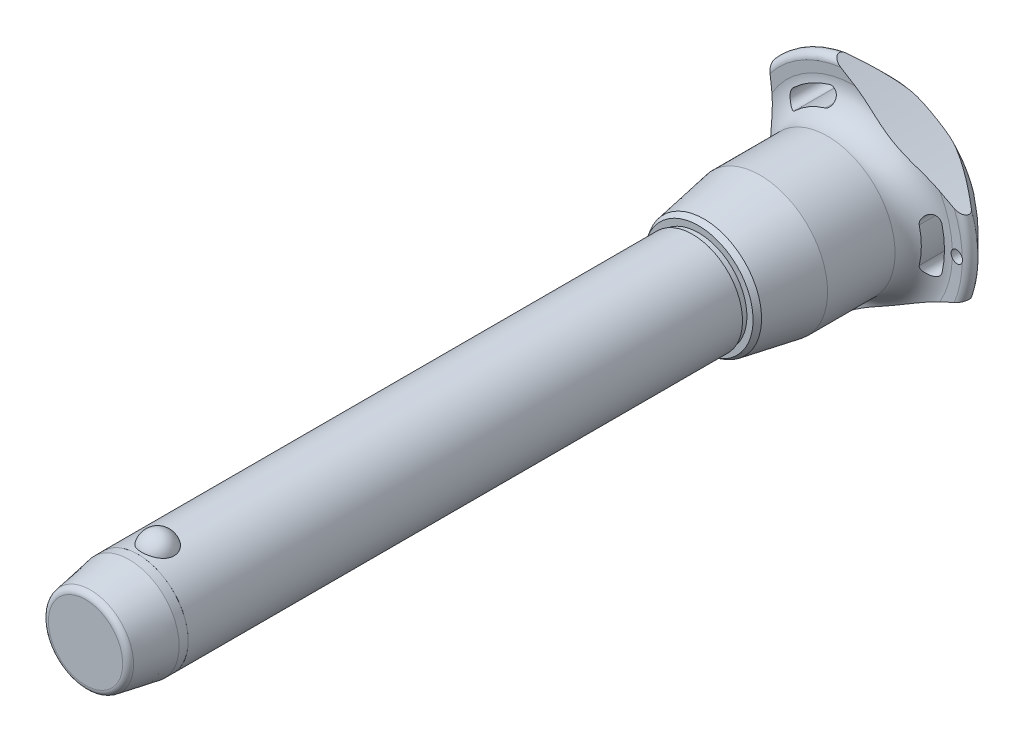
from build123d import *

# Parameters (mm, degrees)
SKETCH1_R           = 12.5
BOSS_EXTRUDE1_DEPTH = 130
SKETCH2_R           = 10
BOSS_EXTRUDE2_DEPTH = 50.7
BOSS_EXTRUDE3_START = 22
SKETCH1_2_R         = 12.5
BOSS_EXTRUDE3_DEPTH = 22
CHAMFER1_SIZE       = 11
CHAMFER1_SIZE2      = 1.939596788
FILLET1_R           = 1.5
SKETCH6_R           = 176.92625
CUT_EXTRUDE1_DEPTH  = 186.156340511
CIRPATTERN1_COUNT   = 3
SKETCH7_R           = 1.5
CUT_EXTRUDE2_DEPTH  = 186.074106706
SKETCH8_R           = 12.5
SKETCH8_R_2         = 12.49
CUT_EXTRUDE3_DEPTH  = 13.2


with BuildPart() as part:
    # Sketch1 → Boss-Extrude1 (new body)
    with BuildSketch(Plane.XY):
        Circle(SKETCH1_R)
    extrude(amount=-BOSS_EXTRUDE1_DEPTH)

    # Sketch2 → Boss-Extrude2 (add)
    with BuildSketch(Plane(origin=(0, 0, -130), x_dir=(-1, 0, 0), z_dir=(0, 0, -1))):
        with Locations(Location((0, 0, 0), (0, 0, 180))):
            Circle(SKETCH2_R)
    extrude(amount=BOSS_EXTRUDE2_DEPTH)

    # Sketch3 → Revolve1 (revolve)
    with BuildSketch(Plane(origin=(0, 0, 0), x_dir=(0, 0, -1), z_dir=(1, 0, 0))):
        with BuildLine():
            Line((-3.957271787, 15.4), (-3.957271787, 7.1))
            ThreePointArc((-3.957271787, 7.1), (0.192728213, 11.25), (-3.957271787, 15.4))
        make_face()
        with BuildLine():
            Line((-3.957271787, -7.1), (-3.957271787, -15.4))
            ThreePointArc((-3.957271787, -15.4), (0.192728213, -11.25), (-3.957271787, -7.1))
        make_face()
    revolve(axis=Axis((0, -7.1, 3.957271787), (0, 1, 0)))

    # Sketch1_2 → Boss-Extrude3 (add)
    with BuildSketch(Plane.XY.offset(BOSS_EXTRUDE3_START)):
        Circle(SKETCH1_2_R)
    extrude(amount=-BOSS_EXTRUDE3_DEPTH)

    # Chamfer1
    chamfer1_edges = [part.edges().sort_by_distance(p)[0] for p in [
        (-12.5, 0, 22),
    ]]
    chamfer1_side = [part.faces().sort_by_distance(p)[0] for p in [
        (-12.5, 0, -54),
    ]]
    chamfer(chamfer1_edges, length=CHAMFER1_SIZE, length2=CHAMFER1_SIZE2, reference=chamfer1_side[0])

    # Fillet1
    fillet1_edges = [part.edges().sort_by_distance(p)[0] for p in [
        (-10.560403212, 0, 22),
        (-10, 0, -180.7),
    ]]
    fillet(fillet1_edges, radius=FILLET1_R)

    # Sketch4 → Revolve2 (revolve)
    with BuildSketch(Plane(origin=(0, 0, 0), x_dir=(0, 0, -1), z_dir=(1, 0, 0)), mode=Mode.PRIVATE) as revolve2_sk:
        Polygon((130, 0), (130, 12.089202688), (131.5, 12.089202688), (131.5, 13.644437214), (132.846872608, 14.422054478), (146.9, 16.9), (163.8, 16.9), (163.8, 0), align=None)
    revolve(revolve2_sk.sketch.rotate(Axis((0, 0, -163.8), (0, 0, 1)), 90), axis=Axis((0, 0, -163.8), (0, 0, 1)))

    # Sketch5 → Revolve3 (revolve)
    with BuildSketch(Plane(origin=(0, 0, 0), x_dir=(0, 0, -1), z_dir=(1, 0, 0)), mode=Mode.PRIVATE) as revolve3_sk:
        with BuildLine():
            Line((170.790129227, 24.271609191), (170.652256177, 26.865060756))
            ThreePointArc((170.652256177, 26.865060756), (171.598671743, 28.411427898), (173.38137085, 28.08137085))
            Line((173.38137085, 28.08137085), (179.763226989, 21.69951471))
            ThreePointArc((179.763226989, 21.69951471), (180.7, 19.381044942), (179.683055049, 17.096604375))
            ThreePointArc((179.683055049, 17.096604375), (174.18864484, 9.321268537), (172.25, 0))
            Line((172.25, 0), (163.8, 0))
            Line((163.8, 0), (163.8, 16.9))
            ThreePointArc((163.8, 16.9), (168.879432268, 19.083427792), (170.790129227, 24.271609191))
        make_face()
    revolve(revolve3_sk.sketch.rotate(Axis((0, 0, -172.25), (0, 0, 1)), 90), axis=Axis((0, 0, -172.25), (0, 0, 1)))

    # Sketch6 → Cut-Extrude1 (cut, through all)
    with BuildSketch(Plane.XY):
        with Locations((-197.42625, 0)):
            Circle(SKETCH6_R)
        with BuildLine():
            ThreePointArc((21.802992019, -5.260839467), (22.428706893, 0), (21.802992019, 5.260839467))
            ThreePointArc((21.802992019, 5.260839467), (19.579234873, 6.620060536), (18.220013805, 4.39630339))
            ThreePointArc((18.220013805, 4.39630339), (18.742902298, 0), (18.220013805, -4.39630339))
            ThreePointArc((18.220013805, -4.39630339), (19.579234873, -6.620060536), (21.802992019, -5.260839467))
        make_face()
    cut_extrude1 = extrude(amount=-CUT_EXTRUDE1_DEPTH, mode=Mode.SUBTRACT)

    # CirPattern1: Cut-Extrude1 ×3 about axis
    cirpattern1_axis = Axis((0, 0, 0), (0, 0, 1))
    for i in range(1, CIRPATTERN1_COUNT):
        add(cut_extrude1.rotate(cirpattern1_axis, i * 360 / CIRPATTERN1_COUNT), mode=Mode.SUBTRACT)

    # Sketch7 → Cut-Extrude2 (cut, through all)
    with BuildSketch(Plane.XY):
        with Locations(Location((25.428706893, 0, 0), (0, 0, 17.230769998))):
            Circle(SKETCH7_R)
    extrude(amount=-CUT_EXTRUDE2_DEPTH, mode=Mode.SUBTRACT)

    # Sketch8 → Cut-Extrude3 (cut)
    with BuildSketch(Plane.XY.offset(22)):
        Circle(SKETCH8_R)
        Circle(SKETCH8_R_2, mode=Mode.SUBTRACT)
    extrude(amount=-CUT_EXTRUDE3_DEPTH, mode=Mode.SUBTRACT)


solid = part.part
